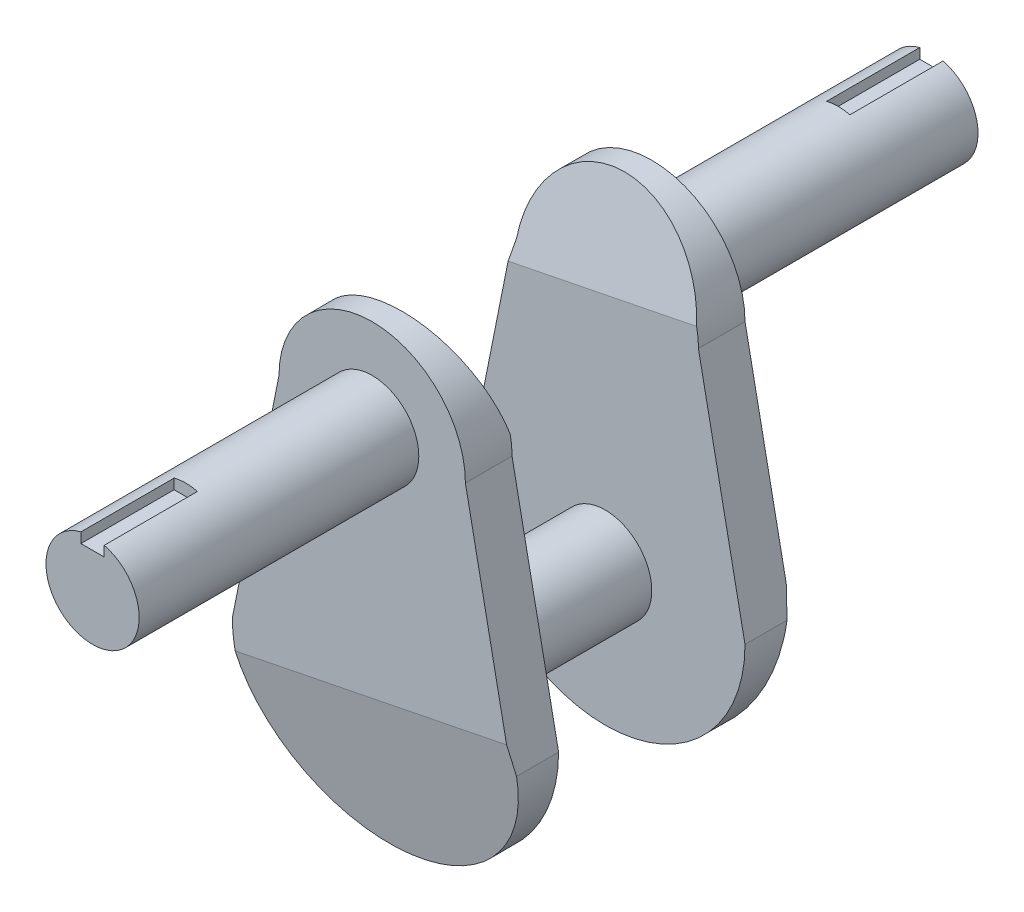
ISO-10303-21;
HEADER;
FILE_DESCRIPTION(('STEP AP214'),'2;1');
FILE_NAME('part.step','',(''),(''),'','','');
FILE_SCHEMA(('AUTOMOTIVE_DESIGN { 1 0 10303 214 1 1 1 1 }'));
ENDSEC;
DATA;
#1=APPLICATION_CONTEXT('core data for automotive mechanical design processes');
#2=APPLICATION_PROTOCOL_DEFINITION('international standard','automotive_design',2000,#1);
#3=PRODUCT_CONTEXT('',#1,'mechanical');
#4=PRODUCT('Part','Part','',(#3));
#5=PRODUCT_RELATED_PRODUCT_CATEGORY('part','',(#4));
#6=PRODUCT_DEFINITION_FORMATION('','',#4);
#7=PRODUCT_DEFINITION_CONTEXT('part definition',#1,'design');
#8=PRODUCT_DEFINITION('design','',#6,#7);
#9=PRODUCT_DEFINITION_SHAPE('','',#8);
#10=(LENGTH_UNIT() NAMED_UNIT(*) SI_UNIT(.MILLI.,.METRE.));
#11=(NAMED_UNIT(*) PLANE_ANGLE_UNIT() SI_UNIT($,.RADIAN.));
#12=(NAMED_UNIT(*) SI_UNIT($,.STERADIAN.) SOLID_ANGLE_UNIT());
#13=UNCERTAINTY_MEASURE_WITH_UNIT(LENGTH_MEASURE(1.E-05),#10,'distance_accuracy_value','');
#14=(GEOMETRIC_REPRESENTATION_CONTEXT(3) GLOBAL_UNCERTAINTY_ASSIGNED_CONTEXT((#13)) GLOBAL_UNIT_ASSIGNED_CONTEXT((#10,
#11,#12)) REPRESENTATION_CONTEXT('',''));
#15=CARTESIAN_POINT('',(0.,0.,0.));
#16=DIRECTION('',(0.,0.,1.));
#17=DIRECTION('',(1.,0.,0.));
#18=AXIS2_PLACEMENT_3D('',#15,#16,#17);
#19=CARTESIAN_POINT('',(0.,0.,25.4));
#20=DIRECTION('',(0.,0.,-1.));
#21=DIRECTION('',(-1.,0.,0.));
#22=AXIS2_PLACEMENT_3D('',#19,#20,#21);
#23=CYLINDRICAL_SURFACE('',#22,12.7);
#24=CARTESIAN_POINT('',(0.,0.,25.4));
#25=DIRECTION('',(0.,0.,1.));
#26=DIRECTION('',(1.,0.,0.));
#27=AXIS2_PLACEMENT_3D('',#24,#25,#26);
#28=CIRCLE('',#27,12.7);
#29=CARTESIAN_POINT('',(12.7,0.,25.4));
#30=VERTEX_POINT('',#29);
#31=EDGE_CURVE('E323',#30,#30,#28,.T.);
#32=ORIENTED_EDGE('',*,*,#31,.F.);
#33=EDGE_LOOP('',(#32));
#34=FACE_BOUND('',#33,.T.);
#35=CARTESIAN_POINT('',(0.,0.,-25.4));
#36=DIRECTION('',(0.,0.,-1.));
#37=DIRECTION('',(-1.,0.,0.));
#38=AXIS2_PLACEMENT_3D('',#35,#36,#37);
#39=CIRCLE('',#38,12.7);
#40=CARTESIAN_POINT('',(-12.7,0.,-25.4));
#41=VERTEX_POINT('',#40);
#42=EDGE_CURVE('E274',#41,#41,#39,.T.);
#43=ORIENTED_EDGE('',*,*,#42,.F.);
#44=EDGE_LOOP('',(#43));
#45=FACE_BOUND('',#44,.T.);
#46=ADVANCED_FACE('F37',(#34,#45),#23,.T.);
#47=CARTESIAN_POINT('',(0.,63.5,38.1));
#48=DIRECTION('',(0.,0.,-1.));
#49=DIRECTION('',(-1.,0.,0.));
#50=AXIS2_PLACEMENT_3D('',#47,#48,#49);
#51=CYLINDRICAL_SURFACE('',#50,25.4);
#52=CARTESIAN_POINT('',(0.,63.5,25.4));
#53=DIRECTION('',(0.,0.,1.));
#54=DIRECTION('',(1.,0.,0.));
#55=AXIS2_PLACEMENT_3D('',#52,#53,#54);
#56=CIRCLE('',#55,25.4);
#57=CARTESIAN_POINT('',(25.4,63.5,25.4));
#58=VERTEX_POINT('',#57);
#59=CARTESIAN_POINT('',(24.9067491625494,68.4813498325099,25.4));
#60=VERTEX_POINT('',#59);
#61=EDGE_CURVE('E290',#58,#60,#56,.T.);
#62=ORIENTED_EDGE('',*,*,#61,.T.);
#63=CARTESIAN_POINT('',(0.,63.5,25.4));
#64=DIRECTION('',(0.0475651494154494,-0.237825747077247,0.970142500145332));
#65=DIRECTION('',(0.190260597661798,-0.951302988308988,-0.242535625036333));
#66=AXIS2_PLACEMENT_3D('',#63,#64,#65);
#67=ELLIPSE('',#66,26.1817207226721,25.4);
#68=CARTESIAN_POINT('',(-25.4,63.5,26.6453374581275));
#69=VERTEX_POINT('',#68);
#70=EDGE_CURVE('E280',#60,#69,#67,.T.);
#71=ORIENTED_EDGE('',*,*,#70,.T.);
#72=DIRECTION('',(0.,0.,-1.));
#73=VECTOR('',#72,1.);
#74=CARTESIAN_POINT('',(-25.4,63.5,38.1));
#75=LINE('',#74,#73);
#76=CARTESIAN_POINT('',(-25.4,63.5,38.1));
#77=VERTEX_POINT('',#76);
#78=EDGE_CURVE('E320',#77,#69,#75,.T.);
#79=ORIENTED_EDGE('',*,*,#78,.F.);
#80=CARTESIAN_POINT('',(0.,63.5,38.1));
#81=DIRECTION('',(0.,0.,1.));
#82=DIRECTION('',(1.,0.,0.));
#83=AXIS2_PLACEMENT_3D('',#80,#81,#82);
#84=CIRCLE('',#83,25.4);
#85=CARTESIAN_POINT('',(25.4,63.5,38.1));
#86=VERTEX_POINT('',#85);
#87=EDGE_CURVE('E293',#86,#77,#84,.T.);
#88=ORIENTED_EDGE('',*,*,#87,.F.);
#89=DIRECTION('',(0.,0.,-1.));
#90=VECTOR('',#89,1.);
#91=CARTESIAN_POINT('',(25.4,63.5,38.1));
#92=LINE('',#91,#90);
#93=EDGE_CURVE('E304',#86,#58,#92,.T.);
#94=ORIENTED_EDGE('',*,*,#93,.T.);
#95=EDGE_LOOP('',(#62,#71,#79,#88,#94));
#96=FACE_BOUND('',#95,.T.);
#97=ADVANCED_FACE('F370',(#96),#51,.T.);
#98=CARTESIAN_POINT('',(-25.4,63.5,38.1));
#99=DIRECTION('',(0.98058067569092,-0.196116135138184,0.));
#100=DIRECTION('',(0.196116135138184,0.98058067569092,0.));
#101=AXIS2_PLACEMENT_3D('',#98,#99,#100);
#102=PLANE('',#101);
#103=ORIENTED_EDGE('',*,*,#78,.T.);
#104=DIRECTION('',(-0.191093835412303,-0.955469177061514,-0.224859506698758));
#105=VECTOR('',#104,1.);
#106=CARTESIAN_POINT('',(-24.9078015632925,65.9609921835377,27.2245057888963));
#107=LINE('',#106,#105);
#108=CARTESIAN_POINT('',(-26.4583333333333,58.2083333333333,25.4));
#109=VERTEX_POINT('',#108);
#110=EDGE_CURVE('E277',#69,#109,#107,.T.);
#111=ORIENTED_EDGE('',*,*,#110,.T.);
#112=DIRECTION('',(-0.196116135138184,-0.98058067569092,0.));
#113=VECTOR('',#112,1.);
#114=CARTESIAN_POINT('',(-25.4,63.5,25.4));
#115=LINE('',#114,#113);
#116=CARTESIAN_POINT('',(-38.1,0.,25.4));
#117=VERTEX_POINT('',#116);
#118=EDGE_CURVE('E307',#109,#117,#115,.T.);
#119=ORIENTED_EDGE('',*,*,#118,.T.);
#120=DIRECTION('',(0.,0.,-1.));
#121=VECTOR('',#120,1.);
#122=CARTESIAN_POINT('',(-38.1,0.,38.1));
#123=LINE('',#122,#121);
#124=CARTESIAN_POINT('',(-38.1,0.,38.1));
#125=VERTEX_POINT('',#124);
#126=EDGE_CURVE('E317',#125,#117,#123,.T.);
#127=ORIENTED_EDGE('',*,*,#126,.F.);
#128=DIRECTION('',(-0.196116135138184,-0.98058067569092,0.));
#129=VECTOR('',#128,1.);
#130=CARTESIAN_POINT('',(-25.4,63.5,38.1));
#131=LINE('',#130,#129);
#132=EDGE_CURVE('E296',#77,#125,#131,.T.);
#133=ORIENTED_EDGE('',*,*,#132,.F.);
#134=EDGE_LOOP('',(#103,#111,#119,#127,#133));
#135=FACE_BOUND('',#134,.T.);
#136=ADVANCED_FACE('F375',(#135),#102,.F.);
#137=CARTESIAN_POINT('',(0.,0.,38.1));
#138=DIRECTION('',(0.,0.,-1.));
#139=DIRECTION('',(-1.,0.,0.));
#140=AXIS2_PLACEMENT_3D('',#137,#138,#139);
#141=CYLINDRICAL_SURFACE('',#140,38.1);
#142=CARTESIAN_POINT('',(0.,0.,38.1));
#143=DIRECTION('',(-0.032241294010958,0.16120647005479,-0.986393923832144));
#144=DIRECTION('',(0.193447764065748,-0.967238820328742,-0.164398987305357));
#145=AXIS2_PLACEMENT_3D('',#142,#143,#144);
#146=ELLIPSE('',#145,38.6255420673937,38.1);
#147=CARTESIAN_POINT('',(38.1,0.,36.8546625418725));
#148=VERTEX_POINT('',#147);
#149=CARTESIAN_POINT('',(-37.3601237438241,-7.47202474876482,38.1));
#150=VERTEX_POINT('',#149);
#151=EDGE_CURVE('E284',#148,#150,#146,.T.);
#152=ORIENTED_EDGE('',*,*,#151,.T.);
#153=CARTESIAN_POINT('',(0.,0.,38.1));
#154=DIRECTION('',(0.,0.,1.));
#155=DIRECTION('',(1.,0.,0.));
#156=AXIS2_PLACEMENT_3D('',#153,#154,#155);
#157=CIRCLE('',#156,38.1);
#158=EDGE_CURVE('E299',#125,#150,#157,.T.);
#159=ORIENTED_EDGE('',*,*,#158,.F.);
#160=ORIENTED_EDGE('',*,*,#126,.T.);
#161=CARTESIAN_POINT('',(0.,0.,25.4));
#162=DIRECTION('',(0.,0.,1.));
#163=DIRECTION('',(1.,0.,0.));
#164=AXIS2_PLACEMENT_3D('',#161,#162,#163);
#165=CIRCLE('',#164,38.1);
#166=CARTESIAN_POINT('',(38.1,0.,25.4));
#167=VERTEX_POINT('',#166);
#168=EDGE_CURVE('E309',#117,#167,#165,.T.);
#169=ORIENTED_EDGE('',*,*,#168,.T.);
#170=DIRECTION('',(0.,0.,-1.));
#171=VECTOR('',#170,1.);
#172=CARTESIAN_POINT('',(38.1,0.,38.1));
#173=LINE('',#172,#171);
#174=EDGE_CURVE('E315',#148,#167,#173,.T.);
#175=ORIENTED_EDGE('',*,*,#174,.F.);
#176=EDGE_LOOP('',(#152,#159,#160,#169,#175));
#177=FACE_BOUND('',#176,.T.);
#178=ADVANCED_FACE('F459',(#177),#141,.T.);
#179=CARTESIAN_POINT('',(25.4,63.5,38.1));
#180=DIRECTION('',(-0.98058067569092,-0.196116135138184,0.));
#181=DIRECTION('',(0.196116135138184,-0.98058067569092,0.));
#182=AXIS2_PLACEMENT_3D('',#179,#180,#181);
#183=PLANE('',#182);
#184=DIRECTION('',(-0.196116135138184,0.98058067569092,0.));
#185=VECTOR('',#184,1.);
#186=CARTESIAN_POINT('',(25.4,63.5,38.1));
#187=LINE('',#186,#185);
#188=CARTESIAN_POINT('',(36.6346153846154,7.32692307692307,38.1));
#189=VERTEX_POINT('',#188);
#190=EDGE_CURVE('E302',#189,#86,#187,.T.);
#191=ORIENTED_EDGE('',*,*,#190,.F.);
#192=DIRECTION('',(-0.193447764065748,0.967238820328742,0.164398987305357));
#193=VECTOR('',#192,1.);
#194=CARTESIAN_POINT('',(36.6346153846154,7.32692307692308,38.1));
#195=LINE('',#194,#193);
#196=EDGE_CURVE('E282',#148,#189,#195,.T.);
#197=ORIENTED_EDGE('',*,*,#196,.F.);
#198=ORIENTED_EDGE('',*,*,#174,.T.);
#199=DIRECTION('',(-0.196116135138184,0.98058067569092,0.));
#200=VECTOR('',#199,1.);
#201=CARTESIAN_POINT('',(25.4,63.5,25.4));
#202=LINE('',#201,#200);
#203=EDGE_CURVE('E297',#167,#58,#202,.T.);
#204=ORIENTED_EDGE('',*,*,#203,.T.);
#205=ORIENTED_EDGE('',*,*,#93,.F.);
#206=EDGE_LOOP('',(#191,#197,#198,#204,#205));
#207=FACE_BOUND('',#206,.T.);
#208=ADVANCED_FACE('F452',(#207),#183,.F.);
#209=CARTESIAN_POINT('',(0.,63.5,38.1));
#210=DIRECTION('',(0.,0.,1.));
#211=DIRECTION('',(1.,0.,0.));
#212=AXIS2_PLACEMENT_3D('',#209,#210,#211);
#213=PLANE('',#212);
#214=DIRECTION('',(-0.98058067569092,-0.196116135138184,0.));
#215=VECTOR('',#214,1.);
#216=CARTESIAN_POINT('',(12.2115384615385,2.4423076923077,38.1));
#217=LINE('',#216,#215);
#218=EDGE_CURVE('E326',#189,#150,#217,.T.);
#219=ORIENTED_EDGE('',*,*,#218,.F.);
#220=ORIENTED_EDGE('',*,*,#190,.T.);
#221=ORIENTED_EDGE('',*,*,#87,.T.);
#222=ORIENTED_EDGE('',*,*,#132,.T.);
#223=ORIENTED_EDGE('',*,*,#158,.T.);
#224=EDGE_LOOP('',(#219,#220,#221,#222,#223));
#225=FACE_BOUND('',#224,.T.);
#226=CARTESIAN_POINT('',(0.,63.5,38.1));
#227=DIRECTION('',(0.,0.,1.));
#228=DIRECTION('',(1.,0.,0.));
#229=AXIS2_PLACEMENT_3D('',#226,#227,#228);
#230=CIRCLE('',#229,12.7);
#231=CARTESIAN_POINT('',(12.7,63.5,38.1));
#232=VERTEX_POINT('',#231);
#233=EDGE_CURVE('E286',#232,#232,#230,.T.);
#234=ORIENTED_EDGE('',*,*,#233,.F.);
#235=EDGE_LOOP('',(#234));
#236=FACE_BOUND('',#235,.T.);
#237=ADVANCED_FACE('F449',(#225,#236),#213,.T.);
#238=CARTESIAN_POINT('',(0.,63.5,25.4));
#239=DIRECTION('',(0.,0.,1.));
#240=DIRECTION('',(1.,0.,0.));
#241=AXIS2_PLACEMENT_3D('',#238,#239,#240);
#242=PLANE('',#241);
#243=ORIENTED_EDGE('',*,*,#31,.T.);
#244=EDGE_LOOP('',(#243));
#245=FACE_BOUND('',#244,.T.);
#246=ORIENTED_EDGE('',*,*,#118,.F.);
#247=DIRECTION('',(0.98058067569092,0.196116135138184,0.));
#248=VECTOR('',#247,1.);
#249=CARTESIAN_POINT('',(0.,63.5,25.4));
#250=LINE('',#249,#248);
#251=EDGE_CURVE('E329',#109,#60,#250,.T.);
#252=ORIENTED_EDGE('',*,*,#251,.T.);
#253=ORIENTED_EDGE('',*,*,#61,.F.);
#254=ORIENTED_EDGE('',*,*,#203,.F.);
#255=ORIENTED_EDGE('',*,*,#168,.F.);
#256=EDGE_LOOP('',(#246,#252,#253,#254,#255));
#257=FACE_BOUND('',#256,.T.);
#258=ADVANCED_FACE('F447',(#245,#257),#242,.F.);
#259=CARTESIAN_POINT('',(0.,63.5,114.3));
#260=DIRECTION('',(0.,0.,-1.));
#261=DIRECTION('',(-1.,0.,0.));
#262=AXIS2_PLACEMENT_3D('',#259,#260,#261);
#263=CYLINDRICAL_SURFACE('',#262,12.7);
#264=CARTESIAN_POINT('',(0.,63.5,88.9));
#265=DIRECTION('',(0.,0.,1.));
#266=DIRECTION('',(1.,0.,0.));
#267=AXIS2_PLACEMENT_3D('',#264,#265,#266);
#268=CIRCLE('',#267,12.7);
#269=CARTESIAN_POINT('',(3.175,75.7967221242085,88.9));
#270=VERTEX_POINT('',#269);
#271=CARTESIAN_POINT('',(-3.175,75.7967221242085,88.9));
#272=VERTEX_POINT('',#271);
#273=EDGE_CURVE('E11',#270,#272,#268,.T.);
#274=ORIENTED_EDGE('',*,*,#273,.F.);
#275=DIRECTION('',(0.,0.,-1.));
#276=VECTOR('',#275,1.);
#277=CARTESIAN_POINT('',(3.175,75.7967221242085,114.3));
#278=LINE('',#277,#276);
#279=CARTESIAN_POINT('',(3.175,75.7967221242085,114.3));
#280=VERTEX_POINT('',#279);
#281=EDGE_CURVE('E201',#270,#280,#278,.F.);
#282=ORIENTED_EDGE('',*,*,#281,.T.);
#283=CARTESIAN_POINT('',(0.,63.5,114.3));
#284=DIRECTION('',(0.,0.,1.));
#285=DIRECTION('',(1.,0.,0.));
#286=AXIS2_PLACEMENT_3D('',#283,#284,#285);
#287=CIRCLE('',#286,12.7);
#288=CARTESIAN_POINT('',(-3.175,75.7967221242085,114.3));
#289=VERTEX_POINT('',#288);
#290=EDGE_CURVE('E287',#289,#280,#287,.T.);
#291=ORIENTED_EDGE('',*,*,#290,.F.);
#292=DIRECTION('',(0.,0.,-1.));
#293=VECTOR('',#292,1.);
#294=CARTESIAN_POINT('',(-3.175,75.7967221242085,114.3));
#295=LINE('',#294,#293);
#296=EDGE_CURVE('E51',#289,#272,#295,.T.);
#297=ORIENTED_EDGE('',*,*,#296,.T.);
#298=EDGE_LOOP('',(#274,#282,#291,#297));
#299=FACE_BOUND('',#298,.T.);
#300=ORIENTED_EDGE('',*,*,#233,.T.);
#301=EDGE_LOOP('',(#300));
#302=FACE_BOUND('',#301,.T.);
#303=ADVANCED_FACE('F443',(#299,#302),#263,.T.);
#304=CARTESIAN_POINT('',(0.,63.5,114.3));
#305=DIRECTION('',(0.,0.,1.));
#306=DIRECTION('',(1.,0.,0.));
#307=AXIS2_PLACEMENT_3D('',#304,#305,#306);
#308=PLANE('',#307);
#309=DIRECTION('',(0.,1.,0.));
#310=VECTOR('',#309,1.);
#311=CARTESIAN_POINT('',(3.175,79.375,114.3));
#312=LINE('',#311,#310);
#313=CARTESIAN_POINT('',(3.175,73.025,114.3));
#314=VERTEX_POINT('',#313);
#315=EDGE_CURVE('E195',#314,#280,#312,.T.);
#316=ORIENTED_EDGE('',*,*,#315,.F.);
#317=DIRECTION('',(1.,0.,0.));
#318=VECTOR('',#317,1.);
#319=CARTESIAN_POINT('',(-3.175,73.025,114.3));
#320=LINE('',#319,#318);
#321=CARTESIAN_POINT('',(-3.175,73.025,114.3));
#322=VERTEX_POINT('',#321);
#323=EDGE_CURVE('E197',#322,#314,#320,.T.);
#324=ORIENTED_EDGE('',*,*,#323,.F.);
#325=DIRECTION('',(0.,-1.,0.));
#326=VECTOR('',#325,1.);
#327=CARTESIAN_POINT('',(-3.175,63.5,114.3));
#328=LINE('',#327,#326);
#329=EDGE_CURVE('E44',#289,#322,#328,.T.);
#330=ORIENTED_EDGE('',*,*,#329,.F.);
#331=ORIENTED_EDGE('',*,*,#290,.T.);
#332=EDGE_LOOP('',(#316,#324,#330,#331));
#333=FACE_BOUND('',#332,.T.);
#334=ADVANCED_FACE('F439',(#333),#308,.T.);
#335=CARTESIAN_POINT('',(-43.9615384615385,-8.7923076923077,38.1));
#336=DIRECTION('',(-0.032241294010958,0.16120647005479,-0.986393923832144));
#337=DIRECTION('',(0.,0.986907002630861,0.161290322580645));
#338=AXIS2_PLACEMENT_3D('',#335,#336,#337);
#339=PLANE('',#338);
#340=ORIENTED_EDGE('',*,*,#151,.F.);
#341=ORIENTED_EDGE('',*,*,#196,.T.);
#342=ORIENTED_EDGE('',*,*,#218,.T.);
#343=EDGE_LOOP('',(#340,#341,#342));
#344=FACE_BOUND('',#343,.T.);
#345=ADVANCED_FACE('F435',(#344),#339,.F.);
#346=CARTESIAN_POINT('',(-61.1544267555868,77.172133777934,31.75));
#347=DIRECTION('',(0.0475651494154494,-0.237825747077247,0.970142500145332));
#348=DIRECTION('',(0.,-0.971241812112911,-0.238095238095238));
#349=AXIS2_PLACEMENT_3D('',#346,#347,#348);
#350=PLANE('',#349);
#351=ORIENTED_EDGE('',*,*,#251,.F.);
#352=ORIENTED_EDGE('',*,*,#110,.F.);
#353=ORIENTED_EDGE('',*,*,#70,.F.);
#354=EDGE_LOOP('',(#351,#352,#353));
#355=FACE_BOUND('',#354,.T.);
#356=ADVANCED_FACE('F432',(#355),#350,.F.);
#357=CARTESIAN_POINT('',(0.,63.5,-38.1));
#358=DIRECTION('',(0.,0.,1.));
#359=DIRECTION('',(1.,0.,0.));
#360=AXIS2_PLACEMENT_3D('',#357,#358,#359);
#361=CYLINDRICAL_SURFACE('',#360,25.4);
#362=DIRECTION('',(0.,0.,1.));
#363=VECTOR('',#362,1.);
#364=CARTESIAN_POINT('',(-25.4,63.5,-38.1));
#365=LINE('',#364,#363);
#366=CARTESIAN_POINT('',(-25.4,63.5,-38.1));
#367=VERTEX_POINT('',#366);
#368=CARTESIAN_POINT('',(-25.4,63.5,-26.6453374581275));
#369=VERTEX_POINT('',#368);
#370=EDGE_CURVE('E255',#367,#369,#365,.T.);
#371=ORIENTED_EDGE('',*,*,#370,.T.);
#372=CARTESIAN_POINT('',(0.,63.5,-25.4));
#373=DIRECTION('',(0.0475651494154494,-0.237825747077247,-0.970142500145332));
#374=DIRECTION('',(0.190260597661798,-0.951302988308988,0.242535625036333));
#375=AXIS2_PLACEMENT_3D('',#372,#373,#374);
#376=ELLIPSE('',#375,26.1817207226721,25.4);
#377=CARTESIAN_POINT('',(24.9067491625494,68.4813498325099,-25.4));
#378=VERTEX_POINT('',#377);
#379=EDGE_CURVE('E229',#369,#378,#376,.T.);
#380=ORIENTED_EDGE('',*,*,#379,.T.);
#381=CARTESIAN_POINT('',(0.,63.5,-25.4));
#382=DIRECTION('',(0.,0.,-1.));
#383=DIRECTION('',(-1.,0.,0.));
#384=AXIS2_PLACEMENT_3D('',#381,#382,#383);
#385=CIRCLE('',#384,25.4);
#386=CARTESIAN_POINT('',(25.4,63.5,-25.4));
#387=VERTEX_POINT('',#386);
#388=EDGE_CURVE('E241',#378,#387,#385,.T.);
#389=ORIENTED_EDGE('',*,*,#388,.T.);
#390=DIRECTION('',(0.,0.,1.));
#391=VECTOR('',#390,1.);
#392=CARTESIAN_POINT('',(25.4,63.5,-38.1));
#393=LINE('',#392,#391);
#394=CARTESIAN_POINT('',(25.4,63.5,-38.1));
#395=VERTEX_POINT('',#394);
#396=EDGE_CURVE('E271',#395,#387,#393,.T.);
#397=ORIENTED_EDGE('',*,*,#396,.F.);
#398=CARTESIAN_POINT('',(0.,63.5,-38.1));
#399=DIRECTION('',(0.,0.,-1.));
#400=DIRECTION('',(-1.,0.,0.));
#401=AXIS2_PLACEMENT_3D('',#398,#399,#400);
#402=CIRCLE('',#401,25.4);
#403=EDGE_CURVE('E244',#367,#395,#402,.T.);
#404=ORIENTED_EDGE('',*,*,#403,.F.);
#405=EDGE_LOOP('',(#371,#380,#389,#397,#404));
#406=FACE_BOUND('',#405,.T.);
#407=ADVANCED_FACE('F393',(#406),#361,.T.);
#408=CARTESIAN_POINT('',(25.4,63.5,-38.1));
#409=DIRECTION('',(-0.98058067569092,-0.196116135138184,0.));
#410=DIRECTION('',(0.196116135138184,-0.98058067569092,0.));
#411=AXIS2_PLACEMENT_3D('',#408,#409,#410);
#412=PLANE('',#411);
#413=DIRECTION('',(0.,0.,1.));
#414=VECTOR('',#413,1.);
#415=CARTESIAN_POINT('',(38.1,0.,-38.1));
#416=LINE('',#415,#414);
#417=CARTESIAN_POINT('',(38.1,0.,-36.8546625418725));
#418=VERTEX_POINT('',#417);
#419=CARTESIAN_POINT('',(38.1,0.,-25.4));
#420=VERTEX_POINT('',#419);
#421=EDGE_CURVE('E269',#418,#420,#416,.T.);
#422=ORIENTED_EDGE('',*,*,#421,.F.);
#423=DIRECTION('',(-0.193447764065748,0.967238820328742,-0.164398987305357));
#424=VECTOR('',#423,1.);
#425=CARTESIAN_POINT('',(25.7036382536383,61.9818087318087,-47.3895442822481));
#426=LINE('',#425,#424);
#427=CARTESIAN_POINT('',(36.6346153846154,7.32692307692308,-38.1));
#428=VERTEX_POINT('',#427);
#429=EDGE_CURVE('E234',#418,#428,#426,.T.);
#430=ORIENTED_EDGE('',*,*,#429,.T.);
#431=DIRECTION('',(0.196116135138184,-0.98058067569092,0.));
#432=VECTOR('',#431,1.);
#433=CARTESIAN_POINT('',(25.4,63.5,-38.1));
#434=LINE('',#433,#432);
#435=EDGE_CURVE('E247',#395,#428,#434,.T.);
#436=ORIENTED_EDGE('',*,*,#435,.F.);
#437=ORIENTED_EDGE('',*,*,#396,.T.);
#438=DIRECTION('',(0.196116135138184,-0.98058067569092,0.));
#439=VECTOR('',#438,1.);
#440=CARTESIAN_POINT('',(25.4,63.5,-25.4));
#441=LINE('',#440,#439);
#442=EDGE_CURVE('E257',#387,#420,#441,.T.);
#443=ORIENTED_EDGE('',*,*,#442,.T.);
#444=EDGE_LOOP('',(#422,#430,#436,#437,#443));
#445=FACE_BOUND('',#444,.T.);
#446=ADVANCED_FACE('F406',(#445),#412,.F.);
#447=CARTESIAN_POINT('',(0.,0.,-38.1));
#448=DIRECTION('',(0.,0.,1.));
#449=DIRECTION('',(1.,0.,0.));
#450=AXIS2_PLACEMENT_3D('',#447,#448,#449);
#451=CYLINDRICAL_SURFACE('',#450,38.1);
#452=CARTESIAN_POINT('',(0.,0.,-38.1));
#453=DIRECTION('',(0.,0.,-1.));
#454=DIRECTION('',(-1.,0.,0.));
#455=AXIS2_PLACEMENT_3D('',#452,#453,#454);
#456=CIRCLE('',#455,38.1);
#457=CARTESIAN_POINT('',(-37.3601237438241,-7.47202474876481,-38.1));
#458=VERTEX_POINT('',#457);
#459=CARTESIAN_POINT('',(-38.1,0.,-38.1));
#460=VERTEX_POINT('',#459);
#461=EDGE_CURVE('E251',#458,#460,#456,.T.);
#462=ORIENTED_EDGE('',*,*,#461,.F.);
#463=CARTESIAN_POINT('',(0.,0.,-38.1));
#464=DIRECTION('',(-0.032241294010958,0.16120647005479,0.986393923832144));
#465=DIRECTION('',(0.193447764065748,-0.967238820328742,0.164398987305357));
#466=AXIS2_PLACEMENT_3D('',#463,#464,#465);
#467=ELLIPSE('',#466,38.6255420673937,38.1);
#468=EDGE_CURVE('E231',#458,#418,#467,.T.);
#469=ORIENTED_EDGE('',*,*,#468,.T.);
#470=ORIENTED_EDGE('',*,*,#421,.T.);
#471=CARTESIAN_POINT('',(0.,0.,-25.4));
#472=DIRECTION('',(0.,0.,-1.));
#473=DIRECTION('',(-1.,0.,0.));
#474=AXIS2_PLACEMENT_3D('',#471,#472,#473);
#475=CIRCLE('',#474,38.1);
#476=CARTESIAN_POINT('',(-38.1,0.,-25.4));
#477=VERTEX_POINT('',#476);
#478=EDGE_CURVE('E260',#420,#477,#475,.T.);
#479=ORIENTED_EDGE('',*,*,#478,.T.);
#480=DIRECTION('',(0.,0.,1.));
#481=VECTOR('',#480,1.);
#482=CARTESIAN_POINT('',(-38.1,0.,-38.1));
#483=LINE('',#482,#481);
#484=EDGE_CURVE('E266',#460,#477,#483,.T.);
#485=ORIENTED_EDGE('',*,*,#484,.F.);
#486=EDGE_LOOP('',(#462,#469,#470,#479,#485));
#487=FACE_BOUND('',#486,.T.);
#488=ADVANCED_FACE('F403',(#487),#451,.T.);
#489=CARTESIAN_POINT('',(-25.4,63.5,-38.1));
#490=DIRECTION('',(0.98058067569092,-0.196116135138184,0.));
#491=DIRECTION('',(0.196116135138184,0.98058067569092,0.));
#492=AXIS2_PLACEMENT_3D('',#489,#490,#491);
#493=PLANE('',#492);
#494=DIRECTION('',(0.196116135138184,0.98058067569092,0.));
#495=VECTOR('',#494,1.);
#496=CARTESIAN_POINT('',(-25.4,63.5,-25.4));
#497=LINE('',#496,#495);
#498=CARTESIAN_POINT('',(-26.4583333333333,58.2083333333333,-25.4));
#499=VERTEX_POINT('',#498);
#500=EDGE_CURVE('E248',#477,#499,#497,.T.);
#501=ORIENTED_EDGE('',*,*,#500,.T.);
#502=DIRECTION('',(0.191093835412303,0.955469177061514,-0.224859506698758));
#503=VECTOR('',#502,1.);
#504=CARTESIAN_POINT('',(-24.9078015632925,65.9609921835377,-27.2245057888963));
#505=LINE('',#504,#503);
#506=EDGE_CURVE('E226',#499,#369,#505,.T.);
#507=ORIENTED_EDGE('',*,*,#506,.T.);
#508=ORIENTED_EDGE('',*,*,#370,.F.);
#509=DIRECTION('',(0.196116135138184,0.98058067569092,0.));
#510=VECTOR('',#509,1.);
#511=CARTESIAN_POINT('',(-25.4,63.5,-38.1));
#512=LINE('',#511,#510);
#513=EDGE_CURVE('E253',#460,#367,#512,.T.);
#514=ORIENTED_EDGE('',*,*,#513,.F.);
#515=ORIENTED_EDGE('',*,*,#484,.T.);
#516=EDGE_LOOP('',(#501,#507,#508,#514,#515));
#517=FACE_BOUND('',#516,.T.);
#518=ADVANCED_FACE('F398',(#517),#493,.F.);
#519=CARTESIAN_POINT('',(0.,63.5,-38.1));
#520=DIRECTION('',(0.,0.,-1.));
#521=DIRECTION('',(-1.,0.,0.));
#522=AXIS2_PLACEMENT_3D('',#519,#520,#521);
#523=PLANE('',#522);
#524=DIRECTION('',(0.98058067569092,0.196116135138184,0.));
#525=VECTOR('',#524,1.);
#526=CARTESIAN_POINT('',(12.2115384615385,2.4423076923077,-38.1));
#527=LINE('',#526,#525);
#528=EDGE_CURVE('E332',#458,#428,#527,.T.);
#529=ORIENTED_EDGE('',*,*,#528,.F.);
#530=ORIENTED_EDGE('',*,*,#461,.T.);
#531=ORIENTED_EDGE('',*,*,#513,.T.);
#532=ORIENTED_EDGE('',*,*,#403,.T.);
#533=ORIENTED_EDGE('',*,*,#435,.T.);
#534=EDGE_LOOP('',(#529,#530,#531,#532,#533));
#535=FACE_BOUND('',#534,.T.);
#536=CARTESIAN_POINT('',(0.,63.5,-38.1));
#537=DIRECTION('',(0.,0.,-1.));
#538=DIRECTION('',(-1.,0.,0.));
#539=AXIS2_PLACEMENT_3D('',#536,#537,#538);
#540=CIRCLE('',#539,12.7);
#541=CARTESIAN_POINT('',(-12.7,63.5,-38.1));
#542=VERTEX_POINT('',#541);
#543=EDGE_CURVE('E237',#542,#542,#540,.T.);
#544=ORIENTED_EDGE('',*,*,#543,.F.);
#545=EDGE_LOOP('',(#544));
#546=FACE_BOUND('',#545,.T.);
#547=ADVANCED_FACE('F384',(#535,#546),#523,.T.);
#548=CARTESIAN_POINT('',(0.,63.5,-25.4));
#549=DIRECTION('',(0.,0.,-1.));
#550=DIRECTION('',(-1.,0.,0.));
#551=AXIS2_PLACEMENT_3D('',#548,#549,#550);
#552=PLANE('',#551);
#553=ORIENTED_EDGE('',*,*,#42,.T.);
#554=EDGE_LOOP('',(#553));
#555=FACE_BOUND('',#554,.T.);
#556=ORIENTED_EDGE('',*,*,#388,.F.);
#557=DIRECTION('',(-0.98058067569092,-0.196116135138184,0.));
#558=VECTOR('',#557,1.);
#559=CARTESIAN_POINT('',(0.,63.5,-25.4));
#560=LINE('',#559,#558);
#561=EDGE_CURVE('E334',#378,#499,#560,.T.);
#562=ORIENTED_EDGE('',*,*,#561,.T.);
#563=ORIENTED_EDGE('',*,*,#500,.F.);
#564=ORIENTED_EDGE('',*,*,#478,.F.);
#565=ORIENTED_EDGE('',*,*,#442,.F.);
#566=EDGE_LOOP('',(#556,#562,#563,#564,#565));
#567=FACE_BOUND('',#566,.T.);
#568=ADVANCED_FACE('F381',(#555,#567),#552,.F.);
#569=CARTESIAN_POINT('',(0.,63.5,-114.3));
#570=DIRECTION('',(0.,0.,1.));
#571=DIRECTION('',(1.,0.,0.));
#572=AXIS2_PLACEMENT_3D('',#569,#570,#571);
#573=CYLINDRICAL_SURFACE('',#572,12.7);
#574=CARTESIAN_POINT('',(0.,63.5,-88.9));
#575=DIRECTION('',(0.,0.,-1.));
#576=DIRECTION('',(-1.,0.,0.));
#577=AXIS2_PLACEMENT_3D('',#574,#575,#576);
#578=CIRCLE('',#577,12.7);
#579=CARTESIAN_POINT('',(-3.175,75.7967221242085,-88.9));
#580=VERTEX_POINT('',#579);
#581=CARTESIAN_POINT('',(3.175,75.7967221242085,-88.9));
#582=VERTEX_POINT('',#581);
#583=EDGE_CURVE('E339',#580,#582,#578,.T.);
#584=ORIENTED_EDGE('',*,*,#583,.F.);
#585=DIRECTION('',(0.,0.,1.));
#586=VECTOR('',#585,1.);
#587=CARTESIAN_POINT('',(-3.175,75.7967221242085,-114.3));
#588=LINE('',#587,#586);
#589=CARTESIAN_POINT('',(-3.175,75.7967221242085,-114.3));
#590=VERTEX_POINT('',#589);
#591=EDGE_CURVE('E223',#580,#590,#588,.F.);
#592=ORIENTED_EDGE('',*,*,#591,.T.);
#593=CARTESIAN_POINT('',(0.,63.5,-114.3));
#594=DIRECTION('',(0.,0.,-1.));
#595=DIRECTION('',(-1.,0.,0.));
#596=AXIS2_PLACEMENT_3D('',#593,#594,#595);
#597=CIRCLE('',#596,12.7);
#598=CARTESIAN_POINT('',(3.175,75.7967221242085,-114.3));
#599=VERTEX_POINT('',#598);
#600=EDGE_CURVE('E238',#599,#590,#597,.T.);
#601=ORIENTED_EDGE('',*,*,#600,.F.);
#602=DIRECTION('',(0.,0.,1.));
#603=VECTOR('',#602,1.);
#604=CARTESIAN_POINT('',(3.175,75.7967221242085,-114.3));
#605=LINE('',#604,#603);
#606=EDGE_CURVE('E59',#599,#582,#605,.T.);
#607=ORIENTED_EDGE('',*,*,#606,.T.);
#608=EDGE_LOOP('',(#584,#592,#601,#607));
#609=FACE_BOUND('',#608,.T.);
#610=ORIENTED_EDGE('',*,*,#543,.T.);
#611=EDGE_LOOP('',(#610));
#612=FACE_BOUND('',#611,.T.);
#613=ADVANCED_FACE('F349',(#609,#612),#573,.T.);
#614=CARTESIAN_POINT('',(0.,63.5,-114.3));
#615=DIRECTION('',(0.,0.,-1.));
#616=DIRECTION('',(-1.,0.,0.));
#617=AXIS2_PLACEMENT_3D('',#614,#615,#616);
#618=PLANE('',#617);
#619=DIRECTION('',(0.,1.,0.));
#620=VECTOR('',#619,1.);
#621=CARTESIAN_POINT('',(-3.175,79.375,-114.3));
#622=LINE('',#621,#620);
#623=CARTESIAN_POINT('',(-3.175,73.025,-114.3));
#624=VERTEX_POINT('',#623);
#625=EDGE_CURVE('E204',#624,#590,#622,.T.);
#626=ORIENTED_EDGE('',*,*,#625,.F.);
#627=DIRECTION('',(-1.,0.,0.));
#628=VECTOR('',#627,1.);
#629=CARTESIAN_POINT('',(3.175,73.025,-114.3));
#630=LINE('',#629,#628);
#631=CARTESIAN_POINT('',(3.175,73.025,-114.3));
#632=VERTEX_POINT('',#631);
#633=EDGE_CURVE('E209',#632,#624,#630,.T.);
#634=ORIENTED_EDGE('',*,*,#633,.F.);
#635=DIRECTION('',(0.,-1.,0.));
#636=VECTOR('',#635,1.);
#637=CARTESIAN_POINT('',(3.175,63.5,-114.3));
#638=LINE('',#637,#636);
#639=EDGE_CURVE('E337',#599,#632,#638,.T.);
#640=ORIENTED_EDGE('',*,*,#639,.F.);
#641=ORIENTED_EDGE('',*,*,#600,.T.);
#642=EDGE_LOOP('',(#626,#634,#640,#641));
#643=FACE_BOUND('',#642,.T.);
#644=ADVANCED_FACE('F353',(#643),#618,.T.);
#645=CARTESIAN_POINT('',(-43.9615384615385,-8.7923076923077,-38.1));
#646=DIRECTION('',(-0.032241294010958,0.16120647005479,0.986393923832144));
#647=DIRECTION('',(0.,-0.986907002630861,0.161290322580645));
#648=AXIS2_PLACEMENT_3D('',#645,#646,#647);
#649=PLANE('',#648);
#650=ORIENTED_EDGE('',*,*,#468,.F.);
#651=ORIENTED_EDGE('',*,*,#528,.T.);
#652=ORIENTED_EDGE('',*,*,#429,.F.);
#653=EDGE_LOOP('',(#650,#651,#652));
#654=FACE_BOUND('',#653,.T.);
#655=ADVANCED_FACE('F411',(#654),#649,.F.);
#656=CARTESIAN_POINT('',(-61.1544267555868,77.172133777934,-31.75));
#657=DIRECTION('',(0.0475651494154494,-0.237825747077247,-0.970142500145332));
#658=DIRECTION('',(0.,0.971241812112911,-0.238095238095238));
#659=AXIS2_PLACEMENT_3D('',#656,#657,#658);
#660=PLANE('',#659);
#661=ORIENTED_EDGE('',*,*,#379,.F.);
#662=ORIENTED_EDGE('',*,*,#506,.F.);
#663=ORIENTED_EDGE('',*,*,#561,.F.);
#664=EDGE_LOOP('',(#661,#662,#663));
#665=FACE_BOUND('',#664,.T.);
#666=ADVANCED_FACE('F366',(#665),#660,.F.);
#667=CARTESIAN_POINT('',(0.,0.,-88.9));
#668=DIRECTION('',(0.,0.,-1.));
#669=DIRECTION('',(-1.,0.,0.));
#670=AXIS2_PLACEMENT_3D('',#667,#668,#669);
#671=PLANE('',#670);
#672=ORIENTED_EDGE('',*,*,#583,.T.);
#673=DIRECTION('',(0.,-1.,0.));
#674=VECTOR('',#673,1.);
#675=CARTESIAN_POINT('',(3.175,79.375,-88.9));
#676=LINE('',#675,#674);
#677=CARTESIAN_POINT('',(3.175,73.025,-88.9));
#678=VERTEX_POINT('',#677);
#679=EDGE_CURVE('E208',#582,#678,#676,.T.);
#680=ORIENTED_EDGE('',*,*,#679,.T.);
#681=DIRECTION('',(-1.,0.,0.));
#682=VECTOR('',#681,1.);
#683=CARTESIAN_POINT('',(3.175,73.025,-88.9));
#684=LINE('',#683,#682);
#685=CARTESIAN_POINT('',(-3.175,73.025,-88.9));
#686=VERTEX_POINT('',#685);
#687=EDGE_CURVE('E211',#678,#686,#684,.T.);
#688=ORIENTED_EDGE('',*,*,#687,.T.);
#689=DIRECTION('',(0.,1.,0.));
#690=VECTOR('',#689,1.);
#691=CARTESIAN_POINT('',(-3.175,79.375,-88.9));
#692=LINE('',#691,#690);
#693=EDGE_CURVE('E205',#686,#580,#692,.T.);
#694=ORIENTED_EDGE('',*,*,#693,.T.);
#695=EDGE_LOOP('',(#672,#680,#688,#694));
#696=FACE_BOUND('',#695,.T.);
#697=ADVANCED_FACE('F342',(#696),#671,.T.);
#698=CARTESIAN_POINT('',(-3.175,79.375,-88.9));
#699=DIRECTION('',(-1.,0.,0.));
#700=DIRECTION('',(0.,0.,1.));
#701=AXIS2_PLACEMENT_3D('',#698,#699,#700);
#702=PLANE('',#701);
#703=ORIENTED_EDGE('',*,*,#693,.F.);
#704=DIRECTION('',(0.,0.,-1.));
#705=VECTOR('',#704,1.);
#706=CARTESIAN_POINT('',(-3.175,73.025,-88.9));
#707=LINE('',#706,#705);
#708=EDGE_CURVE('E218',#686,#624,#707,.T.);
#709=ORIENTED_EDGE('',*,*,#708,.T.);
#710=ORIENTED_EDGE('',*,*,#625,.T.);
#711=ORIENTED_EDGE('',*,*,#591,.F.);
#712=EDGE_LOOP('',(#703,#709,#710,#711));
#713=FACE_BOUND('',#712,.T.);
#714=ADVANCED_FACE('F358',(#713),#702,.F.);
#715=CARTESIAN_POINT('',(3.175,79.375,-88.9));
#716=DIRECTION('',(1.,0.,0.));
#717=DIRECTION('',(0.,1.,0.));
#718=AXIS2_PLACEMENT_3D('',#715,#716,#717);
#719=PLANE('',#718);
#720=ORIENTED_EDGE('',*,*,#639,.T.);
#721=DIRECTION('',(0.,0.,-1.));
#722=VECTOR('',#721,1.);
#723=CARTESIAN_POINT('',(3.175,73.025,-88.9));
#724=LINE('',#723,#722);
#725=EDGE_CURVE('E214',#678,#632,#724,.T.);
#726=ORIENTED_EDGE('',*,*,#725,.F.);
#727=ORIENTED_EDGE('',*,*,#679,.F.);
#728=ORIENTED_EDGE('',*,*,#606,.F.);
#729=EDGE_LOOP('',(#720,#726,#727,#728));
#730=FACE_BOUND('',#729,.T.);
#731=ADVANCED_FACE('F346',(#730),#719,.F.);
#732=CARTESIAN_POINT('',(3.175,73.025,-88.9));
#733=DIRECTION('',(0.,-1.,0.));
#734=DIRECTION('',(0.,0.,-1.));
#735=AXIS2_PLACEMENT_3D('',#732,#733,#734);
#736=PLANE('',#735);
#737=ORIENTED_EDGE('',*,*,#633,.T.);
#738=ORIENTED_EDGE('',*,*,#708,.F.);
#739=ORIENTED_EDGE('',*,*,#687,.F.);
#740=ORIENTED_EDGE('',*,*,#725,.T.);
#741=EDGE_LOOP('',(#737,#738,#739,#740));
#742=FACE_BOUND('',#741,.T.);
#743=ADVANCED_FACE('F356',(#742),#736,.F.);
#744=CARTESIAN_POINT('',(0.,0.,88.9));
#745=DIRECTION('',(0.,0.,1.));
#746=DIRECTION('',(1.,0.,0.));
#747=AXIS2_PLACEMENT_3D('',#744,#745,#746);
#748=PLANE('',#747);
#749=ORIENTED_EDGE('',*,*,#273,.T.);
#750=DIRECTION('',(0.,-1.,0.));
#751=VECTOR('',#750,1.);
#752=CARTESIAN_POINT('',(-3.175,79.375,88.9));
#753=LINE('',#752,#751);
#754=CARTESIAN_POINT('',(-3.175,73.025,88.9));
#755=VERTEX_POINT('',#754);
#756=EDGE_CURVE('E173',#272,#755,#753,.T.);
#757=ORIENTED_EDGE('',*,*,#756,.T.);
#758=DIRECTION('',(1.,0.,0.));
#759=VECTOR('',#758,1.);
#760=CARTESIAN_POINT('',(-3.175,73.025,88.9));
#761=LINE('',#760,#759);
#762=CARTESIAN_POINT('',(3.175,73.025,88.9));
#763=VERTEX_POINT('',#762);
#764=EDGE_CURVE('E178',#755,#763,#761,.T.);
#765=ORIENTED_EDGE('',*,*,#764,.T.);
#766=DIRECTION('',(0.,1.,0.));
#767=VECTOR('',#766,1.);
#768=CARTESIAN_POINT('',(3.175,79.375,88.9));
#769=LINE('',#768,#767);
#770=EDGE_CURVE('E180',#763,#270,#769,.T.);
#771=ORIENTED_EDGE('',*,*,#770,.T.);
#772=EDGE_LOOP('',(#749,#757,#765,#771));
#773=FACE_BOUND('',#772,.T.);
#774=ADVANCED_FACE('F175',(#773),#748,.T.);
#775=CARTESIAN_POINT('',(3.175,79.375,88.9));
#776=DIRECTION('',(1.,0.,0.));
#777=DIRECTION('',(0.,0.,-1.));
#778=AXIS2_PLACEMENT_3D('',#775,#776,#777);
#779=PLANE('',#778);
#780=ORIENTED_EDGE('',*,*,#770,.F.);
#781=DIRECTION('',(0.,0.,1.));
#782=VECTOR('',#781,1.);
#783=CARTESIAN_POINT('',(3.175,73.025,88.9));
#784=LINE('',#783,#782);
#785=EDGE_CURVE('E188',#763,#314,#784,.T.);
#786=ORIENTED_EDGE('',*,*,#785,.T.);
#787=ORIENTED_EDGE('',*,*,#315,.T.);
#788=ORIENTED_EDGE('',*,*,#281,.F.);
#789=EDGE_LOOP('',(#780,#786,#787,#788));
#790=FACE_BOUND('',#789,.T.);
#791=ADVANCED_FACE('F588',(#790),#779,.F.);
#792=CARTESIAN_POINT('',(-3.175,79.375,88.9));
#793=DIRECTION('',(-1.,0.,0.));
#794=DIRECTION('',(0.,-1.,0.));
#795=AXIS2_PLACEMENT_3D('',#792,#793,#794);
#796=PLANE('',#795);
#797=ORIENTED_EDGE('',*,*,#329,.T.);
#798=DIRECTION('',(0.,0.,1.));
#799=VECTOR('',#798,1.);
#800=CARTESIAN_POINT('',(-3.175,73.025,88.9));
#801=LINE('',#800,#799);
#802=EDGE_CURVE('E183',#755,#322,#801,.T.);
#803=ORIENTED_EDGE('',*,*,#802,.F.);
#804=ORIENTED_EDGE('',*,*,#756,.F.);
#805=ORIENTED_EDGE('',*,*,#296,.F.);
#806=EDGE_LOOP('',(#797,#803,#804,#805));
#807=FACE_BOUND('',#806,.T.);
#808=ADVANCED_FACE('F184',(#807),#796,.F.);
#809=CARTESIAN_POINT('',(-3.175,73.025,88.9));
#810=DIRECTION('',(0.,-1.,0.));
#811=DIRECTION('',(0.,0.,-1.));
#812=AXIS2_PLACEMENT_3D('',#809,#810,#811);
#813=PLANE('',#812);
#814=ORIENTED_EDGE('',*,*,#323,.T.);
#815=ORIENTED_EDGE('',*,*,#785,.F.);
#816=ORIENTED_EDGE('',*,*,#764,.F.);
#817=ORIENTED_EDGE('',*,*,#802,.T.);
#818=EDGE_LOOP('',(#814,#815,#816,#817));
#819=FACE_BOUND('',#818,.T.);
#820=ADVANCED_FACE('F190',(#819),#813,.F.);
#821=CLOSED_SHELL('',(#46,#97,#136,#178,#208,#237,#258,#303,#334,#345,#356,#407,#446,#488,#518,
#547,#568,#613,#644,#655,#666,#697,#714,#731,#743,#774,#791,#808,#820));
#822=MANIFOLD_SOLID_BREP('B2',#821);
#823=ADVANCED_BREP_SHAPE_REPRESENTATION('',(#18,#822),#14);
#824=SHAPE_DEFINITION_REPRESENTATION(#9,#823);
ENDSEC;
END-ISO-10303-21;
